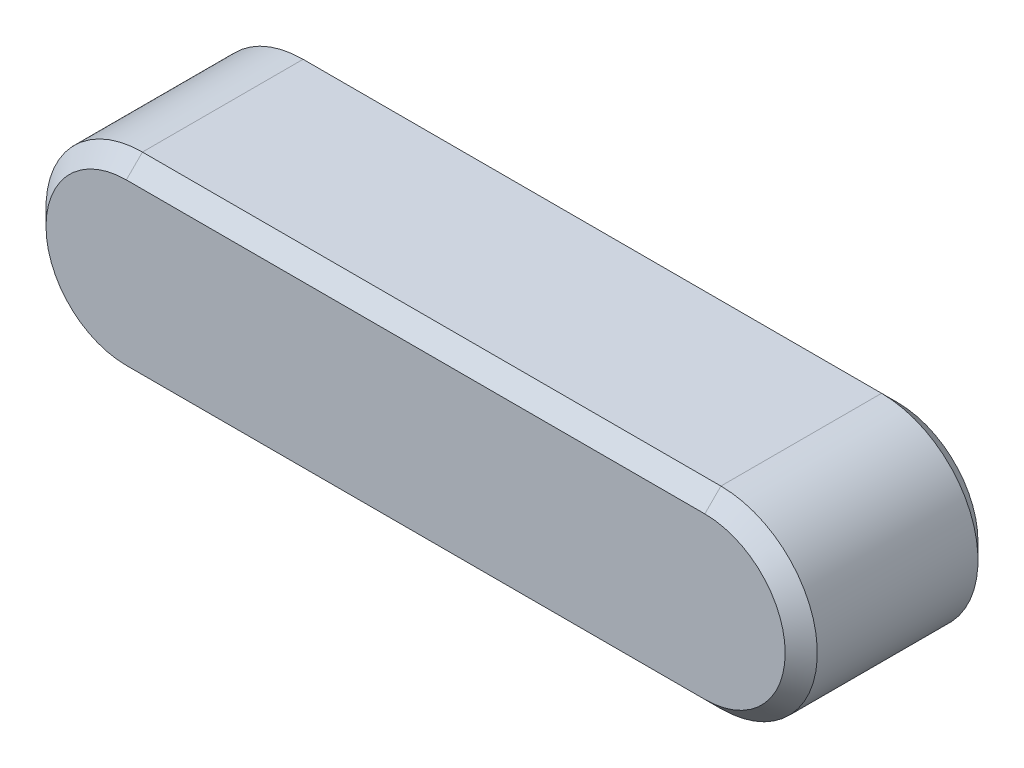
from build123d import *

# Parameters (mm, degrees)
BOSS_EXTRU_1_DEPTH = 6
CHANFREIN1_SIZE    = 0.5


with BuildPart() as part:
    # Esquisse1 → Boss.-Extru.1 (new body)
    with BuildSketch(Plane.XY):
        with BuildLine():
            Line((-287.461782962, 423.327731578), (-305.461782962, 423.327731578))
            ThreePointArc((-305.461782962, 423.327731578), (-308.461782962, 426.327731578), (-305.461782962, 429.327731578))
            Line((-305.461782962, 429.327731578), (-287.461782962, 429.327731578))
            ThreePointArc((-287.461782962, 429.327731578), (-284.461782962, 426.327731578), (-287.461782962, 423.327731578))
        make_face()
    extrude(amount=BOSS_EXTRU_1_DEPTH)

    # Chanfrein1
    chanfrein1_edges = [part.edges().sort_by_distance(p)[0] for p in [
        (-284.461782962, 426.327731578, 6),
        (-296.461782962, 429.327731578, 6),
        (-308.461782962, 426.327731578, 6),
        (-296.461782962, 429.327731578, 0),
        (-284.461782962, 426.327731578, 0),
        (-296.461782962, 423.327731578, 0),
        (-308.461782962, 426.327731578, 0),
        (-296.461782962, 423.327731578, 6),
    ]]
    chamfer(chanfrein1_edges, length=CHANFREIN1_SIZE)


solid = part.part
